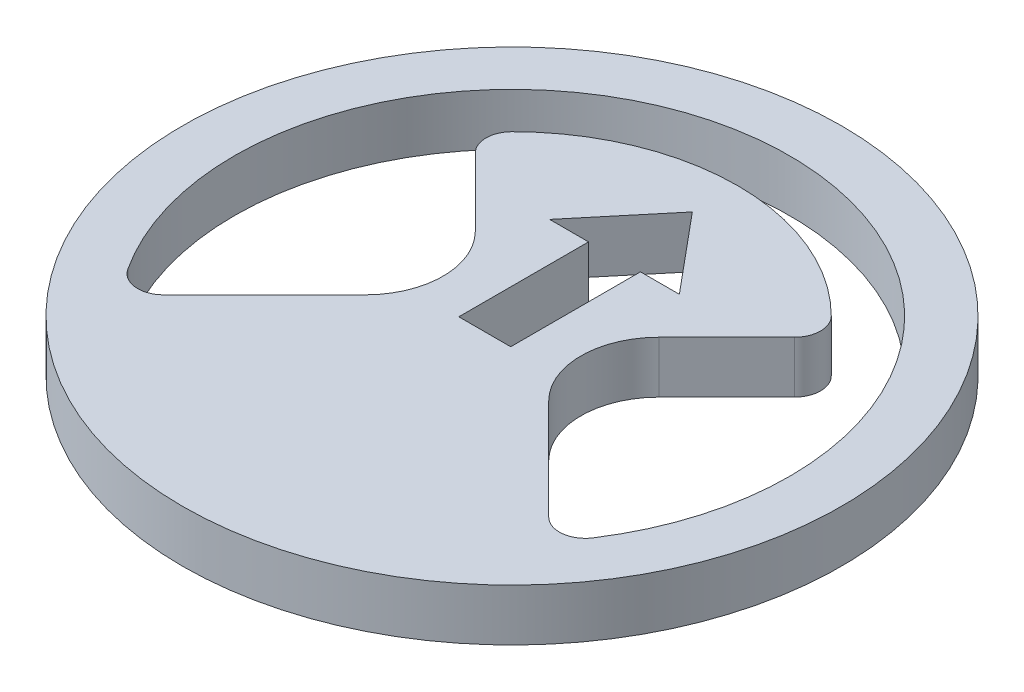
from build123d import *

# Parameters (mm, degrees)
SKETCH1_R           = 12.7
BOSS_EXTRUDE1_DEPTH = 2
CUT_EXTRUDE1_DEPTH  = 2.54
FILLET1_R           = 3
FILLET2_R           = 1
SKETCH3_W           = 2
SKETCH3_H           = 5
CUT_EXTRUDE2_DEPTH  = 19.071524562


with BuildPart() as part:
    # Sketch1 → Boss-Extrude1 (new body)
    with BuildSketch(Plane(origin=(0, 0, 0), x_dir=(1, 0, 0), z_dir=(0, 1, 0))):
        with Locations(Location((0, 0, 0), (0, 0, 270))):
            Circle(SKETCH1_R)
    extrude(amount=BOSS_EXTRUDE1_DEPTH)

    # Sketch2 → Cut-Extrude1 (cut)
    with BuildSketch(Plane(origin=(0, 2, 0), x_dir=(1, 0, 0), z_dir=(0, 1, 0))):
        with BuildLine():
            Line((-8.240034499, -6.825820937), (-1.414213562, 0))
            Line((-1.414213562, 0), (-6.818162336, 5.403948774))
            ThreePointArc((-6.818162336, 5.403948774), (0, 8.7), (6.818162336, 5.403948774))
            Line((6.818162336, 5.403948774), (1.414213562, 0))
            Line((1.414213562, 0), (8.240034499, -6.825820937))
            ThreePointArc((8.240034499, -6.825820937), (0, 10.7), (-8.240034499, -6.825820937))
        make_face()
    extrude(amount=-CUT_EXTRUDE1_DEPTH, mode=Mode.SUBTRACT)

    # Fillet1
    fillet1_edges = [part.edges().sort_by_distance(p)[0] for p in [
        (-1.414213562, 1, 0),
        (1.414213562, 1, 0),
    ]]
    fillet(fillet1_edges, radius=FILLET1_R)

    # Fillet2
    fillet2_edges = [part.edges().sort_by_distance(p)[0] for p in [
        (-6.818162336, 1, -5.403948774),
        (-8.240034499, 1, 6.825820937),
        (8.240034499, 1, 6.825820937),
        (6.818162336, 1, -5.403948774),
    ]]
    fillet(fillet2_edges, radius=FILLET2_R)

    # Sketch3 → Cut-Extrude2 (cut, through all)
    with BuildSketch(Plane(origin=(0, 2, 0), x_dir=(1, 0, 0), z_dir=(0, 1, 0))):
        with Locations((0, 1.45)):
            Rectangle(SKETCH3_W, SKETCH3_H)
        Polygon((0, 6.95), (-2.5, 3.95), (2.5, 3.95), align=None)
    extrude(amount=-CUT_EXTRUDE2_DEPTH, mode=Mode.SUBTRACT)


solid = part.part
